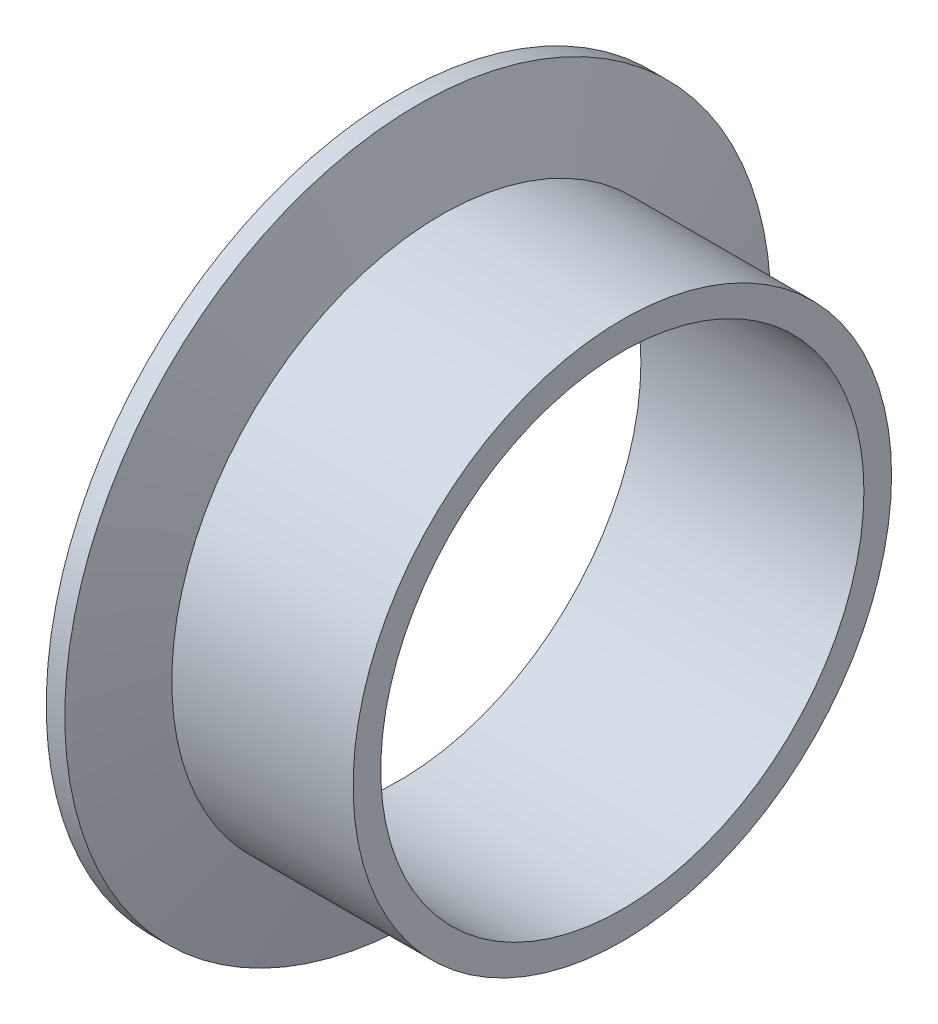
ISO-10303-21;
HEADER;
FILE_DESCRIPTION(('STEP AP214'),'2;1');
FILE_NAME('part.step','',(''),(''),'','','');
FILE_SCHEMA(('AUTOMOTIVE_DESIGN { 1 0 10303 214 1 1 1 1 }'));
ENDSEC;
DATA;
#1=APPLICATION_CONTEXT('core data for automotive mechanical design processes');
#2=APPLICATION_PROTOCOL_DEFINITION('international standard','automotive_design',2000,#1);
#3=PRODUCT_CONTEXT('',#1,'mechanical');
#4=PRODUCT('Part','Part','',(#3));
#5=PRODUCT_RELATED_PRODUCT_CATEGORY('part','',(#4));
#6=PRODUCT_DEFINITION_FORMATION('','',#4);
#7=PRODUCT_DEFINITION_CONTEXT('part definition',#1,'design');
#8=PRODUCT_DEFINITION('design','',#6,#7);
#9=PRODUCT_DEFINITION_SHAPE('','',#8);
#10=(LENGTH_UNIT() NAMED_UNIT(*) SI_UNIT(.MILLI.,.METRE.));
#11=(NAMED_UNIT(*) PLANE_ANGLE_UNIT() SI_UNIT($,.RADIAN.));
#12=(NAMED_UNIT(*) SI_UNIT($,.STERADIAN.) SOLID_ANGLE_UNIT());
#13=UNCERTAINTY_MEASURE_WITH_UNIT(LENGTH_MEASURE(1.E-05),#10,'distance_accuracy_value','');
#14=(GEOMETRIC_REPRESENTATION_CONTEXT(3) GLOBAL_UNCERTAINTY_ASSIGNED_CONTEXT((#13)) GLOBAL_UNIT_ASSIGNED_CONTEXT((#10,
#11,#12)) REPRESENTATION_CONTEXT('',''));
#15=CARTESIAN_POINT('',(0.,0.,0.));
#16=DIRECTION('',(0.,0.,1.));
#17=DIRECTION('',(1.,0.,0.));
#18=AXIS2_PLACEMENT_3D('',#15,#16,#17);
#19=CARTESIAN_POINT('',(97.3319780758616,0.,0.));
#20=DIRECTION('',(-1.,0.,0.));
#21=DIRECTION('',(0.,0.,1.));
#22=AXIS2_PLACEMENT_3D('',#19,#20,#21);
#23=CONICAL_SURFACE('',#22,22.9997,1.30159527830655);
#24=CARTESIAN_POINT('',(95.3557746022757,0.,0.));
#25=DIRECTION('',(1.,0.,0.));
#26=DIRECTION('',(0.,0.,-1.));
#27=AXIS2_PLACEMENT_3D('',#24,#25,#26);
#28=CIRCLE('',#27,30.1625);
#29=CARTESIAN_POINT('',(95.3557746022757,0.,-30.1625));
#30=VERTEX_POINT('',#29);
#31=EDGE_CURVE('E10',#30,#30,#28,.T.);
#32=ORIENTED_EDGE('',*,*,#31,.T.);
#33=EDGE_LOOP('',(#32));
#34=FACE_BOUND('',#33,.T.);
#35=CARTESIAN_POINT('',(97.3319780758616,0.,0.));
#36=DIRECTION('',(1.,0.,0.));
#37=DIRECTION('',(0.,0.,-1.));
#38=AXIS2_PLACEMENT_3D('',#35,#36,#37);
#39=CIRCLE('',#38,22.9997);
#40=CARTESIAN_POINT('',(97.3319780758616,0.,-22.9997));
#41=VERTEX_POINT('',#40);
#42=EDGE_CURVE('E55',#41,#41,#39,.T.);
#43=ORIENTED_EDGE('',*,*,#42,.F.);
#44=EDGE_LOOP('',(#43));
#45=FACE_BOUND('',#44,.T.);
#46=ADVANCED_FACE('F33',(#34,#45),#23,.T.);
#47=CARTESIAN_POINT('',(125.720278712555,0.,0.));
#48=DIRECTION('',(1.,0.,0.));
#49=DIRECTION('',(0.,0.,-1.));
#50=AXIS2_PLACEMENT_3D('',#47,#48,#49);
#51=CYLINDRICAL_SURFACE('',#50,30.1625);
#52=CARTESIAN_POINT('',(93.7682746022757,0.,0.));
#53=DIRECTION('',(1.,0.,0.));
#54=DIRECTION('',(0.,0.,-1.));
#55=AXIS2_PLACEMENT_3D('',#52,#53,#54);
#56=CIRCLE('',#55,30.1625);
#57=CARTESIAN_POINT('',(93.7682746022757,0.,-30.1625));
#58=VERTEX_POINT('',#57);
#59=EDGE_CURVE('E39',#58,#58,#56,.T.);
#60=ORIENTED_EDGE('',*,*,#59,.T.);
#61=EDGE_LOOP('',(#60));
#62=FACE_BOUND('',#61,.T.);
#63=ORIENTED_EDGE('',*,*,#31,.F.);
#64=EDGE_LOOP('',(#63));
#65=FACE_BOUND('',#64,.T.);
#66=ADVANCED_FACE('F63',(#62,#65),#51,.T.);
#67=CARTESIAN_POINT('',(93.7682746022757,30.1625,0.));
#68=DIRECTION('',(-1.,0.,0.));
#69=DIRECTION('',(0.,0.,1.));
#70=AXIS2_PLACEMENT_3D('',#67,#68,#69);
#71=PLANE('',#70);
#72=CARTESIAN_POINT('',(93.7682746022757,0.,0.));
#73=DIRECTION('',(1.,0.,0.));
#74=DIRECTION('',(0.,0.,-1.));
#75=AXIS2_PLACEMENT_3D('',#72,#73,#74);
#76=CIRCLE('',#75,20.6375);
#77=CARTESIAN_POINT('',(93.7682746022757,0.,-20.6375));
#78=VERTEX_POINT('',#77);
#79=EDGE_CURVE('E43',#78,#78,#76,.T.);
#80=ORIENTED_EDGE('',*,*,#79,.T.);
#81=EDGE_LOOP('',(#80));
#82=FACE_BOUND('',#81,.T.);
#83=ORIENTED_EDGE('',*,*,#59,.F.);
#84=EDGE_LOOP('',(#83));
#85=FACE_BOUND('',#84,.T.);
#86=ADVANCED_FACE('F67',(#82,#85),#71,.T.);
#87=CARTESIAN_POINT('',(125.720278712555,0.,0.));
#88=DIRECTION('',(1.,0.,0.));
#89=DIRECTION('',(0.,0.,-1.));
#90=AXIS2_PLACEMENT_3D('',#87,#88,#89);
#91=CYLINDRICAL_SURFACE('',#90,20.6375);
#92=CARTESIAN_POINT('',(112.818274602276,0.,0.));
#93=DIRECTION('',(1.,0.,0.));
#94=DIRECTION('',(0.,0.,-1.));
#95=AXIS2_PLACEMENT_3D('',#92,#93,#94);
#96=CIRCLE('',#95,20.6375);
#97=CARTESIAN_POINT('',(112.818274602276,0.,-20.6375));
#98=VERTEX_POINT('',#97);
#99=EDGE_CURVE('E47',#98,#98,#96,.T.);
#100=ORIENTED_EDGE('',*,*,#99,.T.);
#101=EDGE_LOOP('',(#100));
#102=FACE_BOUND('',#101,.T.);
#103=ORIENTED_EDGE('',*,*,#79,.F.);
#104=EDGE_LOOP('',(#103));
#105=FACE_BOUND('',#104,.T.);
#106=ADVANCED_FACE('F71',(#102,#105),#91,.F.);
#107=CARTESIAN_POINT('',(112.818274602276,20.6375,0.));
#108=DIRECTION('',(1.,0.,0.));
#109=DIRECTION('',(0.,0.,-1.));
#110=AXIS2_PLACEMENT_3D('',#107,#108,#109);
#111=PLANE('',#110);
#112=CARTESIAN_POINT('',(112.818274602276,0.,0.));
#113=DIRECTION('',(1.,0.,0.));
#114=DIRECTION('',(0.,0.,-1.));
#115=AXIS2_PLACEMENT_3D('',#112,#113,#114);
#116=CIRCLE('',#115,22.9997);
#117=CARTESIAN_POINT('',(112.818274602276,0.,-22.9997));
#118=VERTEX_POINT('',#117);
#119=EDGE_CURVE('E52',#118,#118,#116,.T.);
#120=ORIENTED_EDGE('',*,*,#119,.T.);
#121=EDGE_LOOP('',(#120));
#122=FACE_BOUND('',#121,.T.);
#123=ORIENTED_EDGE('',*,*,#99,.F.);
#124=EDGE_LOOP('',(#123));
#125=FACE_BOUND('',#124,.T.);
#126=ADVANCED_FACE('F78',(#122,#125),#111,.T.);
#127=CARTESIAN_POINT('',(125.720278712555,0.,0.));
#128=DIRECTION('',(1.,0.,0.));
#129=DIRECTION('',(0.,0.,-1.));
#130=AXIS2_PLACEMENT_3D('',#127,#128,#129);
#131=CYLINDRICAL_SURFACE('',#130,22.9997);
#132=ORIENTED_EDGE('',*,*,#42,.T.);
#133=EDGE_LOOP('',(#132));
#134=FACE_BOUND('',#133,.T.);
#135=ORIENTED_EDGE('',*,*,#119,.F.);
#136=EDGE_LOOP('',(#135));
#137=FACE_BOUND('',#136,.T.);
#138=ADVANCED_FACE('F59',(#134,#137),#131,.T.);
#139=CLOSED_SHELL('',(#46,#66,#86,#106,#126,#138));
#140=MANIFOLD_SOLID_BREP('B2',#139);
#141=ADVANCED_BREP_SHAPE_REPRESENTATION('',(#18,#140),#14);
#142=SHAPE_DEFINITION_REPRESENTATION(#9,#141);
ENDSEC;
END-ISO-10303-21;
